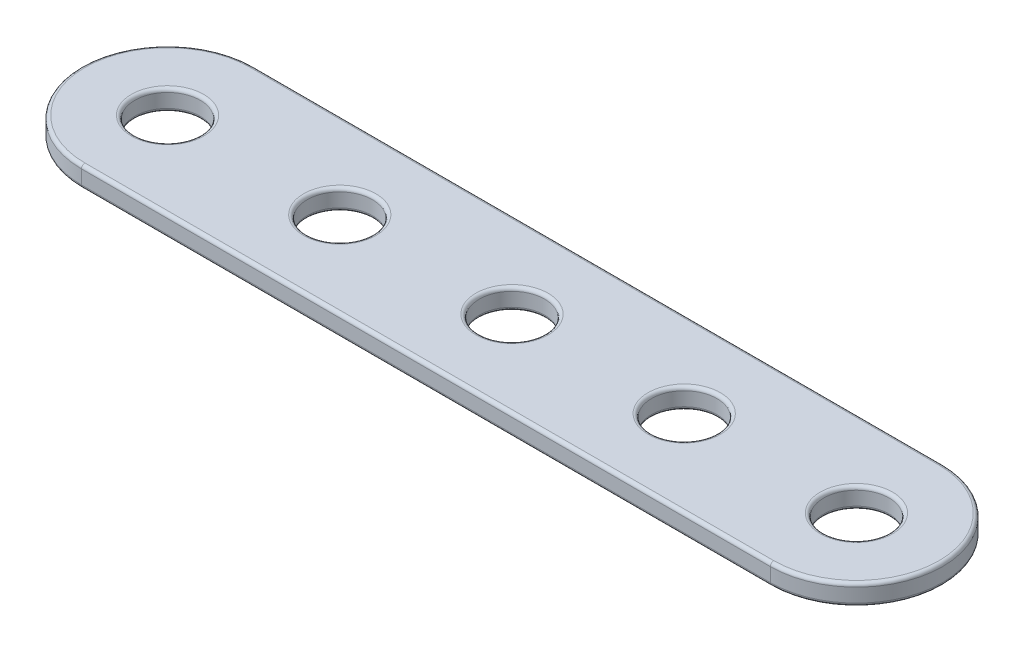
from build123d import *

# Parameters (mm, degrees)
EXTRUDE1_DEPTH     = 1.524
SKETCH2_R          = 2.413
CUT_EXTRUDE1_DEPTH = 59.563940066
LPATTERN1_COUNT    = 5
LPATTERN1_PITCH    = 12.7
FILLET1_R          = 0.254


with BuildPart() as part:
    # Sketch1 → Extrude1 (new body)
    with BuildSketch(Plane(origin=(0, 0, 0), x_dir=(1, 0, 0), z_dir=(0, 1, 0))):
        with BuildLine():
            Line((0, 0), (50.8, 0))
            ThreePointArc((50.8, 0), (57.15, 6.35), (50.8, 12.7))
            Line((50.8, 12.7), (0, 12.7))
            ThreePointArc((0, 12.7), (-6.35, 6.35), (0, 0))
        make_face()
    extrude(amount=EXTRUDE1_DEPTH)

    # Sketch2 → Cut-Extrude1 (cut, through all)
    with BuildSketch(Plane(origin=(0, 1.524, 0), x_dir=(-1, 0, 0), z_dir=(0, 1, 0))):
        with Locations(Location((0, -6.35, 0), (0, 0, 90))):
            Circle(SKETCH2_R)
    cut_extrude1 = extrude(amount=-CUT_EXTRUDE1_DEPTH, mode=Mode.SUBTRACT)

    # LPattern1: Cut-Extrude1 ×5
    with Locations(*[(i * LPATTERN1_PITCH, 0, 0) for i in range(1, LPATTERN1_COUNT)]):
        add(cut_extrude1, mode=Mode.SUBTRACT)

    # Fillet1
    fillet1_edges = [part.edges().sort_by_distance(p)[0] for p in [
        (57.15, 1.524, -6.35),
        (25.4, 1.524, -12.7),
        (0, 0, -8.763),
        (0, 1.524, -8.763),
        (12.7, 0, -8.763),
        (12.7, 1.524, -8.763),
        (25.4, 0, -8.763),
        (25.4, 1.524, -8.763),
        (38.1, 0, -8.763),
        (38.1, 1.524, -8.763),
        (50.8, 0, -8.763),
        (50.8, 1.524, -8.763),
        (-6.35, 1.524, -6.35),
        (25.4, 0, -12.7),
        (57.15, 0, -6.35),
        (25.4, 0, 0),
        (-6.35, 0, -6.35),
        (25.4, 1.524, 0),
    ]]
    fillet(fillet1_edges, radius=FILLET1_R)


solid = part.part
